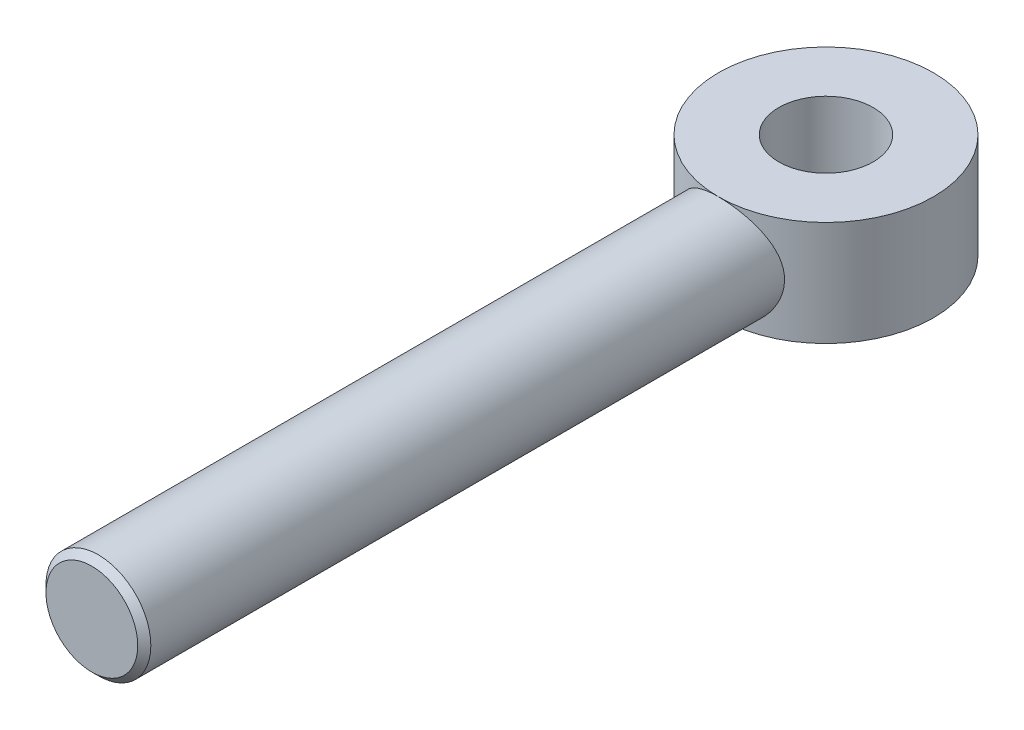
ISO-10303-21;
HEADER;
FILE_DESCRIPTION(('STEP AP214'),'2;1');
FILE_NAME('part.step','',(''),(''),'','','');
FILE_SCHEMA(('AUTOMOTIVE_DESIGN { 1 0 10303 214 1 1 1 1 }'));
ENDSEC;
DATA;
#1=APPLICATION_CONTEXT('core data for automotive mechanical design processes');
#2=APPLICATION_PROTOCOL_DEFINITION('international standard','automotive_design',2000,#1);
#3=PRODUCT_CONTEXT('',#1,'mechanical');
#4=PRODUCT('Part','Part','',(#3));
#5=PRODUCT_RELATED_PRODUCT_CATEGORY('part','',(#4));
#6=PRODUCT_DEFINITION_FORMATION('','',#4);
#7=PRODUCT_DEFINITION_CONTEXT('part definition',#1,'design');
#8=PRODUCT_DEFINITION('design','',#6,#7);
#9=PRODUCT_DEFINITION_SHAPE('','',#8);
#10=(LENGTH_UNIT() NAMED_UNIT(*) SI_UNIT(.MILLI.,.METRE.));
#11=(NAMED_UNIT(*) PLANE_ANGLE_UNIT() SI_UNIT($,.RADIAN.));
#12=(NAMED_UNIT(*) SI_UNIT($,.STERADIAN.) SOLID_ANGLE_UNIT());
#13=UNCERTAINTY_MEASURE_WITH_UNIT(LENGTH_MEASURE(1.E-05),#10,'distance_accuracy_value','');
#14=(GEOMETRIC_REPRESENTATION_CONTEXT(3) GLOBAL_UNCERTAINTY_ASSIGNED_CONTEXT((#13)) GLOBAL_UNIT_ASSIGNED_CONTEXT((#10,
#11,#12)) REPRESENTATION_CONTEXT('',''));
#15=CARTESIAN_POINT('',(0.,0.,0.));
#16=DIRECTION('',(0.,0.,1.));
#17=DIRECTION('',(1.,0.,0.));
#18=AXIS2_PLACEMENT_3D('',#15,#16,#17);
#19=CARTESIAN_POINT('',(0.,0.,140.));
#20=DIRECTION('',(0.,0.,-1.));
#21=DIRECTION('',(-1.,0.,0.));
#22=AXIS2_PLACEMENT_3D('',#19,#20,#21);
#23=CYLINDRICAL_SURFACE('',#22,10.);
#24=CARTESIAN_POINT('',(0.,0.,138.75));
#25=DIRECTION('',(0.,0.,1.));
#26=DIRECTION('',(1.,0.,0.));
#27=AXIS2_PLACEMENT_3D('',#24,#25,#26);
#28=CIRCLE('',#27,10.);
#29=CARTESIAN_POINT('',(10.,0.,138.75));
#30=VERTEX_POINT('',#29);
#31=EDGE_CURVE('E60',#30,#30,#28,.F.);
#32=ORIENTED_EDGE('',*,*,#31,.T.);
#33=EDGE_LOOP('',(#32));
#34=FACE_BOUND('',#33,.T.);
#35=CARTESIAN_POINT('',(-10.,0.,17.8955301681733));
#36=CARTESIAN_POINT('',(-9.99999843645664,0.26163963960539,17.8955321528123));
#37=CARTESIAN_POINT('',(-9.98971773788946,0.523313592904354,17.901287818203));
#38=CARTESIAN_POINT('',(-9.94872366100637,1.04466428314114,17.9241019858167));
#39=CARTESIAN_POINT('',(-9.91800015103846,1.30433996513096,17.9411660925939));
#40=CARTESIAN_POINT('',(-9.83645267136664,1.82001498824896,17.9860045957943));
#41=CARTESIAN_POINT('',(-9.78559530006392,2.07600748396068,18.0137967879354));
#42=CARTESIAN_POINT('',(-9.6643778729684,2.58216206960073,18.079118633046));
#43=CARTESIAN_POINT('',(-9.59400941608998,2.83232159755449,18.1166524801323));
#44=CARTESIAN_POINT('',(-9.43499100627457,3.32374410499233,18.1999710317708));
#45=CARTESIAN_POINT('',(-9.34644534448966,3.56504896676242,18.2457084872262));
#46=CARTESIAN_POINT('',(-9.15162238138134,4.03899537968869,18.3442011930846));
#47=CARTESIAN_POINT('',(-9.0453386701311,4.27163376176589,18.396958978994));
#48=CARTESIAN_POINT('',(-8.81592948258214,4.72698279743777,18.5079878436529));
#49=CARTESIAN_POINT('',(-8.69280861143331,4.94969614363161,18.5662574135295));
#50=CARTESIAN_POINT('',(-8.43051698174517,5.38431182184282,18.6868192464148));
#51=CARTESIAN_POINT('',(-8.29134570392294,5.59621380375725,18.7491116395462));
#52=CARTESIAN_POINT('',(-7.98620064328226,6.02453827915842,18.8812171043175));
#53=CARTESIAN_POINT('',(-7.81898050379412,6.24001002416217,18.951236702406));
#54=CARTESIAN_POINT('',(-7.46776604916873,6.65632200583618,19.0923617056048));
#55=CARTESIAN_POINT('',(-7.28377612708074,6.8571660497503,19.16346682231));
#56=CARTESIAN_POINT('',(-6.89974752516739,7.2434600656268,19.3050613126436));
#57=CARTESIAN_POINT('',(-6.69969614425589,7.42889761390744,19.3755501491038));
#58=CARTESIAN_POINT('',(-6.28470196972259,7.78311755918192,19.5141066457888));
#59=CARTESIAN_POINT('',(-6.06976452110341,7.9519058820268,19.5821751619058));
#60=CARTESIAN_POINT('',(-5.61179305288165,8.28205590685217,19.7184791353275));
#61=CARTESIAN_POINT('',(-5.36784139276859,8.44225805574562,19.7864485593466));
#62=CARTESIAN_POINT('',(-4.86555802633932,8.74138347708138,19.9159132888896));
#63=CARTESIAN_POINT('',(-4.60722554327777,8.88030559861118,19.9774082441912));
#64=CARTESIAN_POINT('',(-4.07795746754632,9.13545406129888,20.092126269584));
#65=CARTESIAN_POINT('',(-3.8070277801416,9.25169090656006,20.1453531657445));
#66=CARTESIAN_POINT('',(-3.25441508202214,9.46023108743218,20.2419718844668));
#67=CARTESIAN_POINT('',(-2.97273315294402,9.5525368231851,20.2853646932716));
#68=CARTESIAN_POINT('',(-2.42041103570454,9.70660140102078,20.3583849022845));
#69=CARTESIAN_POINT('',(-2.15032954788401,9.77001523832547,20.3887497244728));
#70=CARTESIAN_POINT('',(-1.60487450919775,9.87428272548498,20.4389178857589));
#71=CARTESIAN_POINT('',(-1.32950117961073,9.91513731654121,20.4587216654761));
#72=CARTESIAN_POINT('',(-0.775866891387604,9.97373960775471,20.4871868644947));
#73=CARTESIAN_POINT('',(-0.497607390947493,9.99149845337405,20.4958536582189));
#74=CARTESIAN_POINT('',(0.0595374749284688,10.0037033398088,20.5018059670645));
#75=CARTESIAN_POINT('',(0.338422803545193,9.99815071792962,20.4990921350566));
#76=CARTESIAN_POINT('',(0.87131783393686,9.96524223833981,20.4830631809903));
#77=CARTESIAN_POINT('',(1.12547129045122,9.93973396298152,20.4706464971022));
#78=CARTESIAN_POINT('',(1.63046394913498,9.86947654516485,20.4366245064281));
#79=CARTESIAN_POINT('',(1.88130337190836,9.82472869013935,20.4150198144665));
#80=CARTESIAN_POINT('',(2.37798456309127,9.71647051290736,20.3631418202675));
#81=CARTESIAN_POINT('',(2.62382616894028,9.65295958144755,20.3328682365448));
#82=CARTESIAN_POINT('',(3.10895604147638,9.50781305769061,20.2643632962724));
#83=CARTESIAN_POINT('',(3.34824407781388,9.42617682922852,20.2261316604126));
#84=CARTESIAN_POINT('',(3.82219733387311,9.24424850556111,20.1419842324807));
#85=CARTESIAN_POINT('',(4.05675021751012,9.14371019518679,20.0959679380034));
#86=CARTESIAN_POINT('',(4.51647211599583,8.92559689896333,19.9976706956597));
#87=CARTESIAN_POINT('',(4.74163776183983,8.80801586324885,19.9453875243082));
#88=CARTESIAN_POINT('',(5.40127308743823,8.43104513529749,19.7808280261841));
#89=CARTESIAN_POINT('',(5.82016635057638,8.14731740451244,19.6607889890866));
#90=CARTESIAN_POINT('',(6.64454548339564,7.49343306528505,19.3985557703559));
#91=CARTESIAN_POINT('',(7.04533357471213,7.11775754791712,19.2553394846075));
#92=CARTESIAN_POINT('',(7.5965109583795,6.50908460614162,19.0415888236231));
#93=CARTESIAN_POINT('',(7.77201020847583,6.29850021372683,18.9704670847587));
#94=CARTESIAN_POINT('',(8.10551298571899,5.86308920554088,18.8303828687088));
#95=CARTESIAN_POINT('',(8.26351395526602,5.63826051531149,18.7614207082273));
#96=CARTESIAN_POINT('',(8.56967385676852,5.16192696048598,18.6236549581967));
#97=CARTESIAN_POINT('',(8.71671406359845,4.90963093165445,18.5550973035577));
#98=CARTESIAN_POINT('',(8.98872661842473,4.39184047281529,18.4248617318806));
#99=CARTESIAN_POINT('',(9.11370887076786,4.1263520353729,18.3631807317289));
#100=CARTESIAN_POINT('',(9.34035650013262,3.58386659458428,18.2489411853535));
#101=CARTESIAN_POINT('',(9.44203496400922,3.3068761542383,18.1963775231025));
#102=CARTESIAN_POINT('',(9.62091075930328,2.74325610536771,18.1024392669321));
#103=CARTESIAN_POINT('',(9.69811125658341,2.45662774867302,18.0610632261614));
#104=CARTESIAN_POINT('',(9.82191568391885,1.89872322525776,17.9940138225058));
#105=CARTESIAN_POINT('',(9.8704330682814,1.62798808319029,17.9673690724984));
#106=CARTESIAN_POINT('',(9.94504324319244,1.08252820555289,17.926180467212));
#107=CARTESIAN_POINT('',(9.97113726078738,0.807803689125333,17.911635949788));
#108=CARTESIAN_POINT('',(10.0005023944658,0.256907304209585,17.8952573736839));
#109=CARTESIAN_POINT('',(10.0037858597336,-0.0192637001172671,17.8934164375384));
#110=CARTESIAN_POINT('',(9.98751052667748,-0.570709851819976,17.902506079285));
#111=CARTESIAN_POINT('',(9.96795310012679,-0.845985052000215,17.9134358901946));
#112=CARTESIAN_POINT('',(9.90944913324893,-1.36527337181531,17.9458571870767));
#113=CARTESIAN_POINT('',(9.87268383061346,-1.6096111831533,17.9661576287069));
#114=CARTESIAN_POINT('',(9.78139457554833,-2.09406294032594,18.0160213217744));
#115=CARTESIAN_POINT('',(9.72686470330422,-2.33417544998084,18.045587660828));
#116=CARTESIAN_POINT('',(9.6006254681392,-2.80859847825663,18.1130644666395));
#117=CARTESIAN_POINT('',(9.52891866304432,-3.0429098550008,18.1509736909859));
#118=CARTESIAN_POINT('',(9.36898703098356,-3.5045446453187,18.2340391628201));
#119=CARTESIAN_POINT('',(9.28075566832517,-3.7318652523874,18.2791982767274));
#120=CARTESIAN_POINT('',(8.98347592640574,-4.42214905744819,18.4281817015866));
#121=CARTESIAN_POINT('',(8.74762578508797,-4.8716610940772,18.5422635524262));
#122=CARTESIAN_POINT('',(8.21303426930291,-5.72720728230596,18.7851527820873));
#123=CARTESIAN_POINT('',(7.91426088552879,-6.13321914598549,18.9139676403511));
#124=CARTESIAN_POINT('',(7.40419219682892,-6.72733033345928,19.117188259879));
#125=CARTESIAN_POINT('',(7.2122580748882,-6.93270011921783,19.1905924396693));
#126=CARTESIAN_POINT('',(6.81162379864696,-7.32670860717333,19.3364206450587));
#127=CARTESIAN_POINT('',(6.60292875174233,-7.5153523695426,19.408844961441));
#128=CARTESIAN_POINT('',(6.16965886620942,-7.87493695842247,19.5508907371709));
#129=CARTESIAN_POINT('',(5.94507296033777,-8.04586523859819,19.6205101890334));
#130=CARTESIAN_POINT('',(5.48139225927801,-8.3686372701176,19.7550646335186));
#131=CARTESIAN_POINT('',(5.24230374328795,-8.52048919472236,19.8200016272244));
#132=CARTESIAN_POINT('',(4.74541220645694,-8.80710639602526,19.9448768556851));
#133=CARTESIAN_POINT('',(4.48731256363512,-8.94142046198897,20.0046730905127));
#134=CARTESIAN_POINT('',(3.95887041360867,-9.18761682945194,20.1159200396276));
#135=CARTESIAN_POINT('',(3.68852754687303,-9.29949847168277,20.1673705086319));
#136=CARTESIAN_POINT('',(3.13773540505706,-9.49949443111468,20.2603691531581));
#137=CARTESIAN_POINT('',(2.8572931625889,-9.58762493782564,20.3019240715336));
#138=CARTESIAN_POINT('',(2.28839925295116,-9.73908842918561,20.3738899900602));
#139=CARTESIAN_POINT('',(1.99994848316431,-9.80242418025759,20.4043022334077));
#140=CARTESIAN_POINT('',(1.44348187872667,-9.89893298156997,20.4508499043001));
#141=CARTESIAN_POINT('',(1.17592839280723,-9.93428652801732,20.468013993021));
#142=CARTESIAN_POINT('',(0.638377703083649,-9.98325080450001,20.4918235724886));
#143=CARTESIAN_POINT('',(0.368380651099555,-9.99686287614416,20.4984697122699));
#144=CARTESIAN_POINT('',(-0.171804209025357,-10.0021710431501,20.5010590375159));
#145=CARTESIAN_POINT('',(-0.441991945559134,-9.99387308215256,20.4970051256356));
#146=CARTESIAN_POINT('',(-0.980439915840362,-9.95547998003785,20.4783129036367));
#147=CARTESIAN_POINT('',(-1.24870019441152,-9.92538534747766,20.4636748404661));
#148=CARTESIAN_POINT('',(-1.76495224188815,-9.8462652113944,20.4254210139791));
#149=CARTESIAN_POINT('',(-2.01318386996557,-9.79850342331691,20.4024059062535));
#150=CARTESIAN_POINT('',(-2.50442999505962,-9.68459604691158,20.347945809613));
#151=CARTESIAN_POINT('',(-2.74744476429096,-9.61845142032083,20.3165012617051));
#152=CARTESIAN_POINT('',(-3.22675245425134,-9.46842804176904,20.2459070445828));
#153=CARTESIAN_POINT('',(-3.46304594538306,-9.38455079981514,20.2067580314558));
#154=CARTESIAN_POINT('',(-3.92769587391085,-9.1997688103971,20.1216058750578));
#155=CARTESIAN_POINT('',(-4.15604922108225,-9.09885752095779,20.075600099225));
#156=CARTESIAN_POINT('',(-4.61332943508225,-8.87607268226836,19.9755933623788));
#157=CARTESIAN_POINT('',(-4.84184719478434,-8.75347699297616,19.9213312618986));
#158=CARTESIAN_POINT('',(-5.28780597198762,-8.4915259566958,19.8076270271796));
#159=CARTESIAN_POINT('',(-5.5052431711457,-8.35216488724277,19.7481831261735));
#160=CARTESIAN_POINT('',(-5.92801602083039,-8.05760611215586,19.625419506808));
#161=CARTESIAN_POINT('',(-6.13334917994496,-7.9024051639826,19.5620989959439));
#162=CARTESIAN_POINT('',(-6.530994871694,-7.57707770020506,19.4329569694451));
#163=CARTESIAN_POINT('',(-6.72330667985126,-7.40695035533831,19.3671353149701));
#164=CARTESIAN_POINT('',(-7.11180372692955,-7.03570584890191,19.2280725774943));
#165=CARTESIAN_POINT('',(-7.30660704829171,-6.83318066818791,19.1547229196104));
#166=CARTESIAN_POINT('',(-7.6785386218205,-6.41240007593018,19.008681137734));
#167=CARTESIAN_POINT('',(-7.85567192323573,-6.19414918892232,18.9359888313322));
#168=CARTESIAN_POINT('',(-8.19147188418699,-5.74273380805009,18.7931666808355));
#169=CARTESIAN_POINT('',(-8.350121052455,-5.50955550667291,18.7230393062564));
#170=CARTESIAN_POINT('',(-8.64771203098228,-5.02959391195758,18.5874641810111));
#171=CARTESIAN_POINT('',(-8.78665123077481,-4.78280882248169,18.5220170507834));
#172=CARTESIAN_POINT('',(-9.04687072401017,-4.27067358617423,18.3963456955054));
#173=CARTESIAN_POINT('',(-9.16762727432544,-4.00501471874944,18.3362913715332));
#174=CARTESIAN_POINT('',(-9.38594119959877,-3.46258843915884,18.2255069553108));
#175=CARTESIAN_POINT('',(-9.48351049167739,-3.18582681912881,18.1747720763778));
#176=CARTESIAN_POINT('',(-9.65409696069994,-2.62381874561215,18.0847367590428));
#177=CARTESIAN_POINT('',(-9.72717772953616,-2.33859639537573,18.0454067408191));
#178=CARTESIAN_POINT('',(-9.84803671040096,-1.76152308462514,17.9797369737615));
#179=CARTESIAN_POINT('',(-9.89583291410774,-1.46967699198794,17.9533879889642));
#180=CARTESIAN_POINT('',(-9.95369329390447,-0.981078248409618,17.9213459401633));
#181=CARTESIAN_POINT('',(-9.97104444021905,-0.78541354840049,17.9116845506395));
#182=CARTESIAN_POINT('',(-9.99419873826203,-0.393172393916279,17.8987757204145));
#183=CARTESIAN_POINT('',(-10.0000011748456,-0.196595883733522,17.8955286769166));
#184=CARTESIAN_POINT('',(-10.,0.,17.8955301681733));
#185=B_SPLINE_CURVE_WITH_KNOTS('',3,(#35,#36,#37,#38,#39,#40,#41,#42,#43,#44,#45,#46,#47,#48,
#49,#50,#51,#52,#53,#54,#55,#56,#57,#58,#59,#60,#61,#62,#63,#64,#65,#66,#67,#68,#69,#70,#71,#72,
#73,#74,#75,#76,#77,#78,#79,#80,#81,#82,#83,#84,#85,#86,#87,#88,#89,#90,#91,#92,#93,#94,#95,#96,
#97,#98,#99,#100,#101,#102,#103,#104,#105,#106,#107,#108,#109,#110,#111,#112,#113,#114,#115,
#116,#117,#118,#119,#120,#121,#122,#123,#124,#125,#126,#127,#128,#129,#130,#131,#132,#133,#134,
#135,#136,#137,#138,#139,#140,#141,#142,#143,#144,#145,#146,#147,#148,#149,#150,#151,#152,#153,
#154,#155,#156,#157,#158,#159,#160,#161,#162,#163,#164,#165,#166,#167,#168,#169,#170,#171,#172,
#173,#174,#175,#176,#177,#178,#179,#180,#181,#182,#183,#184),.UNSPECIFIED.,.T.,.F.,(4,2,2,2,2,2,
2,2,2,2,2,2,2,2,2,2,2,2,2,2,2,2,2,2,2,2,2,2,2,2,2,2,2,2,2,2,2,2,2,2,2,2,2,2,2,2,2,2,2,2,2,2,2,2,
2,2,2,2,2,2,2,2,2,2,2,2,2,2,2,2,2,2,2,2,4),(0.,0.784715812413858,1.56982082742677,
2.35623380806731,3.14298592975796,3.92534428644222,4.70798597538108,5.49041402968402,
6.27286740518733,7.11673835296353,7.96038887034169,8.80471322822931,9.6487359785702,
10.5465692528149,11.4444510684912,12.3419161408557,13.2392911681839,14.0754135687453,
14.9115010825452,15.7471849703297,16.5828209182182,17.3491115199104,18.1153508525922,
18.8816150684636,19.647906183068,20.424973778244,21.2023178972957,22.7560853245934,
24.4513989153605,25.3002707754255,26.1492665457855,27.0479958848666,27.9463206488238,
28.8441396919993,29.7418425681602,30.5696885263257,31.3974891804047,32.2248416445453,
33.0521444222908,33.7950597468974,34.5382228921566,35.2812754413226,36.024622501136,
37.5788522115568,39.1338744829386,40.0046070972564,40.8750753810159,41.7461559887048,
42.6168620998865,43.5067899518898,44.3967439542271,45.286089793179,46.1753363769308,
46.9855483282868,47.7957102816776,48.6056524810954,49.4155757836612,50.1762030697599,
50.9367905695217,51.6973133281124,52.4581288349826,53.2521167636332,54.0463764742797,
54.8407991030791,55.6352658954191,56.5055534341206,57.3755915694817,58.246446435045,
59.1174165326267,60.0099990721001,60.9021218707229,61.7919097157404,62.6810635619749,
63.2706620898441,63.8602971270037),.UNSPECIFIED.);
#186=CARTESIAN_POINT('',(0.,10.,20.5));
#187=VERTEX_POINT('',#186);
#188=CARTESIAN_POINT('',(0.,-10.,20.5));
#189=VERTEX_POINT('',#188);
#190=EDGE_CURVE('E11',#187,#189,#185,.T.);
#191=ORIENTED_EDGE('',*,*,#190,.F.);
#192=EDGE_CURVE('E36',#189,#187,#185,.T.);
#193=ORIENTED_EDGE('',*,*,#192,.F.);
#194=EDGE_LOOP('',(#191,#193));
#195=FACE_BOUND('',#194,.T.);
#196=ADVANCED_FACE('F32',(#34,#195),#23,.T.);
#197=CARTESIAN_POINT('',(0.,0.,140.));
#198=DIRECTION('',(0.,0.,1.));
#199=DIRECTION('',(1.,0.,0.));
#200=AXIS2_PLACEMENT_3D('',#197,#198,#199);
#201=PLANE('',#200);
#202=CARTESIAN_POINT('',(0.,0.,140.));
#203=DIRECTION('',(0.,0.,1.));
#204=DIRECTION('',(1.,0.,0.));
#205=AXIS2_PLACEMENT_3D('',#202,#203,#204);
#206=CIRCLE('',#205,8.75000000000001);
#207=CARTESIAN_POINT('',(8.75000000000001,0.,140.));
#208=VERTEX_POINT('',#207);
#209=EDGE_CURVE('E57',#208,#208,#206,.T.);
#210=ORIENTED_EDGE('',*,*,#209,.T.);
#211=EDGE_LOOP('',(#210));
#212=FACE_BOUND('',#211,.T.);
#213=ADVANCED_FACE('F72',(#212),#201,.T.);
#214=CARTESIAN_POINT('',(0.,0.,140.));
#215=DIRECTION('',(0.,0.,-1.));
#216=DIRECTION('',(-1.,0.,0.));
#217=AXIS2_PLACEMENT_3D('',#214,#215,#216);
#218=CONICAL_SURFACE('',#217,8.75000000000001,0.785398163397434);
#219=ORIENTED_EDGE('',*,*,#31,.F.);
#220=EDGE_LOOP('',(#219));
#221=FACE_BOUND('',#220,.T.);
#222=ORIENTED_EDGE('',*,*,#209,.F.);
#223=EDGE_LOOP('',(#222));
#224=FACE_BOUND('',#223,.T.);
#225=ADVANCED_FACE('F34',(#221,#224),#218,.T.);
#226=CARTESIAN_POINT('',(0.,10.,0.));
#227=DIRECTION('',(0.,-1.,0.));
#228=DIRECTION('',(0.,0.,-1.));
#229=AXIS2_PLACEMENT_3D('',#226,#227,#228);
#230=CYLINDRICAL_SURFACE('',#229,20.5);
#231=CARTESIAN_POINT('',(0.,10.,0.));
#232=DIRECTION('',(0.,1.,0.));
#233=DIRECTION('',(0.,0.,1.));
#234=AXIS2_PLACEMENT_3D('',#231,#232,#233);
#235=CIRCLE('',#234,20.5);
#236=EDGE_CURVE('E54',#187,#187,#235,.T.);
#237=ORIENTED_EDGE('',*,*,#236,.F.);
#238=ORIENTED_EDGE('',*,*,#190,.T.);
#239=CARTESIAN_POINT('',(0.,-10.,0.));
#240=DIRECTION('',(0.,1.,0.));
#241=DIRECTION('',(0.,0.,1.));
#242=AXIS2_PLACEMENT_3D('',#239,#240,#241);
#243=CIRCLE('',#242,20.5);
#244=EDGE_CURVE('E56',#189,#189,#243,.T.);
#245=ORIENTED_EDGE('',*,*,#244,.T.);
#246=ORIENTED_EDGE('',*,*,#192,.T.);
#247=EDGE_LOOP('',(#237,#238,#245,#246));
#248=FACE_BOUND('',#247,.T.);
#249=ADVANCED_FACE('F53',(#248),#230,.T.);
#250=CARTESIAN_POINT('',(0.,10.,0.));
#251=DIRECTION('',(0.,1.,0.));
#252=DIRECTION('',(0.,0.,1.));
#253=AXIS2_PLACEMENT_3D('',#250,#251,#252);
#254=PLANE('',#253);
#255=CARTESIAN_POINT('',(0.,10.,0.));
#256=DIRECTION('',(0.,1.,0.));
#257=DIRECTION('',(0.,0.,1.));
#258=AXIS2_PLACEMENT_3D('',#255,#256,#257);
#259=CIRCLE('',#258,9.);
#260=CARTESIAN_POINT('',(0.,10.,9.));
#261=VERTEX_POINT('',#260);
#262=EDGE_CURVE('E67',#261,#261,#259,.T.);
#263=ORIENTED_EDGE('',*,*,#262,.F.);
#264=EDGE_LOOP('',(#263));
#265=FACE_BOUND('',#264,.T.);
#266=ORIENTED_EDGE('',*,*,#236,.T.);
#267=EDGE_LOOP('',(#266));
#268=FACE_BOUND('',#267,.T.);
#269=ADVANCED_FACE('F59',(#265,#268),#254,.T.);
#270=CARTESIAN_POINT('',(0.,-10.,0.));
#271=DIRECTION('',(0.,1.,0.));
#272=DIRECTION('',(0.,0.,1.));
#273=AXIS2_PLACEMENT_3D('',#270,#271,#272);
#274=PLANE('',#273);
#275=CARTESIAN_POINT('',(0.,-10.,0.));
#276=DIRECTION('',(0.,1.,0.));
#277=DIRECTION('',(0.,0.,1.));
#278=AXIS2_PLACEMENT_3D('',#275,#276,#277);
#279=CIRCLE('',#278,9.);
#280=CARTESIAN_POINT('',(0.,-10.,9.));
#281=VERTEX_POINT('',#280);
#282=EDGE_CURVE('E64',#281,#281,#279,.T.);
#283=ORIENTED_EDGE('',*,*,#282,.T.);
#284=EDGE_LOOP('',(#283));
#285=FACE_BOUND('',#284,.T.);
#286=ORIENTED_EDGE('',*,*,#244,.F.);
#287=EDGE_LOOP('',(#286));
#288=FACE_BOUND('',#287,.T.);
#289=ADVANCED_FACE('F89',(#285,#288),#274,.F.);
#290=CARTESIAN_POINT('',(0.,-10.,0.));
#291=DIRECTION('',(0.,1.,0.));
#292=DIRECTION('',(0.,0.,1.));
#293=AXIS2_PLACEMENT_3D('',#290,#291,#292);
#294=CYLINDRICAL_SURFACE('',#293,9.);
#295=ORIENTED_EDGE('',*,*,#282,.F.);
#296=EDGE_LOOP('',(#295));
#297=FACE_BOUND('',#296,.T.);
#298=ORIENTED_EDGE('',*,*,#262,.T.);
#299=EDGE_LOOP('',(#298));
#300=FACE_BOUND('',#299,.T.);
#301=ADVANCED_FACE('F92',(#297,#300),#294,.F.);
#302=CLOSED_SHELL('',(#196,#213,#225,#249,#269,#289,#301));
#303=MANIFOLD_SOLID_BREP('B2',#302);
#304=ADVANCED_BREP_SHAPE_REPRESENTATION('',(#18,#303),#14);
#305=SHAPE_DEFINITION_REPRESENTATION(#9,#304);
ENDSEC;
END-ISO-10303-21;
